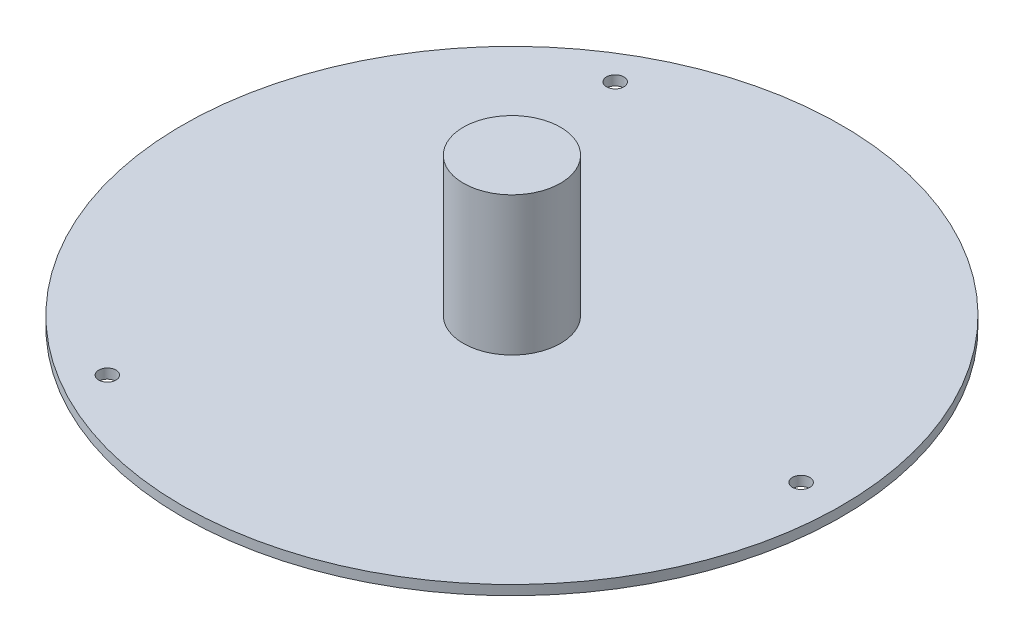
from build123d import *

# Parameters (mm, degrees)
SKETCH1_R           = 60.325
BOSS_EXTRUDE1_DEPTH = 1.778
SKETCH2_R           = 1.5875
CUT_EXTRUDE1_DEPTH  = 86.330958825
SKETCH3_R           = 8.89
BOSS_EXTRUDE2_DEPTH = 25.4


with BuildPart() as part:
    # Sketch1 → Boss-Extrude1 (new body)
    with BuildSketch(Plane(origin=(0, 0, 0), x_dir=(1, 0, 0), z_dir=(0, 1, 0))):
        with Locations(Location((0, 0, 0), (0, 0, 270))):
            Circle(SKETCH1_R)
    extrude(amount=BOSS_EXTRUDE1_DEPTH)

    # Sketch2 → Cut-Extrude1 (cut, through all)
    with BuildSketch(Plane(origin=(0, 1.778, 0), x_dir=(1, 0, 0), z_dir=(0, 1, 0))):
        with Locations(Location((52.934543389, 0, 0), (0, 0, 270))):
            Circle(SKETCH2_R)
        with Locations(Location((-27.574642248, 46.482, 0), (0, 0, 270))):
            Circle(SKETCH2_R)
        with Locations(Location((-27.574642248, -46.482, 0), (0, 0, 270))):
            Circle(SKETCH2_R)
    extrude(amount=-CUT_EXTRUDE1_DEPTH, mode=Mode.SUBTRACT)

    # Sketch3 → Boss-Extrude2 (add)
    with BuildSketch(Plane(origin=(0, 1.778, 0), x_dir=(1, 0, 0), z_dir=(0, 1, 0))):
        with Locations(Location((0, 0, 0), (0, 0, 270))):
            Circle(SKETCH3_R)
    extrude(amount=BOSS_EXTRUDE2_DEPTH)


solid = part.part
